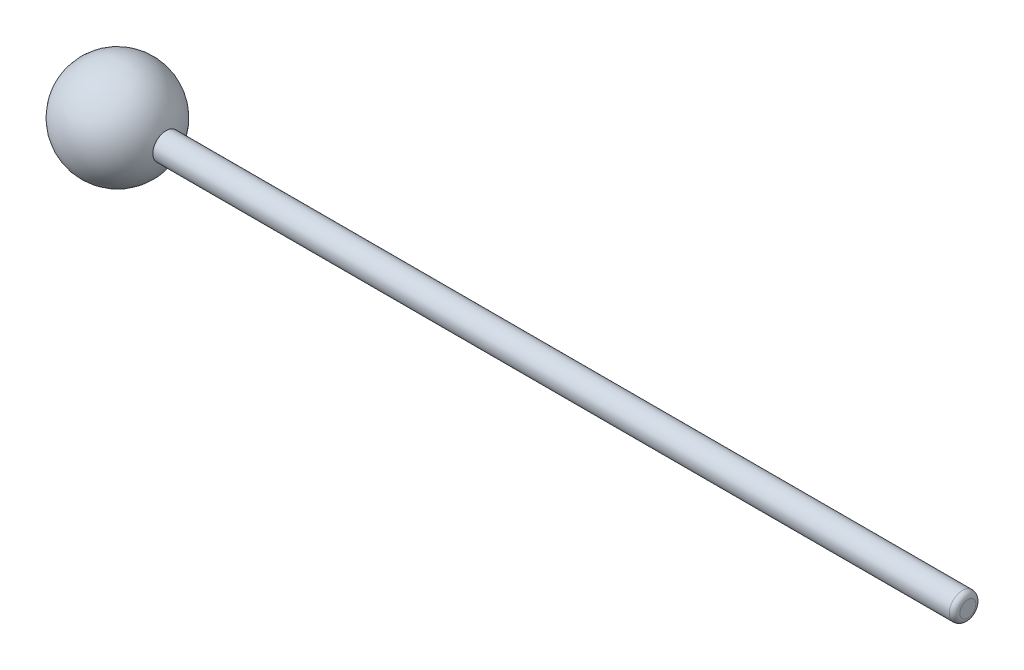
from build123d import *

# Parameters (mm, degrees)
SKETCH3_R           = 2.5
BOSS_EXTRUDE1_DEPTH = 160
FILLET1_R           = 1


with BuildPart() as part:
    # Sketch2 → Revolve1 (revolve)
    with BuildSketch(Plane.XY):
        with BuildLine():
            Line((0, 0), (-9.5, 0))
            ThreePointArc((-9.5, 0), (-1.261162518, 9.415915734), (9.16515139, 2.5))
            Line((9.16515139, 2.5), (0, 2.5))
            Line((0, 2.5), (0, 0))
        make_face()
    revolve(axis=Axis((0, 0, 0), (-1, 0, 0)))


with BuildPart() as body_2:
    # Sketch3 → Boss-Extrude1 (new body)
    with BuildSketch(Plane(origin=(0, 0, 0), x_dir=(0, 0, -1), z_dir=(1, 0, 0))):
        Circle(SKETCH3_R)
    extrude(amount=BOSS_EXTRUDE1_DEPTH)

    # Fillet1
    fillet1_edges = [body_2.edges().sort_by_distance(p)[0] for p in [
        (160, 0, 2.5),
    ]]
    fillet(fillet1_edges, radius=FILLET1_R)


solid = Compound([part.part, body_2.part])
